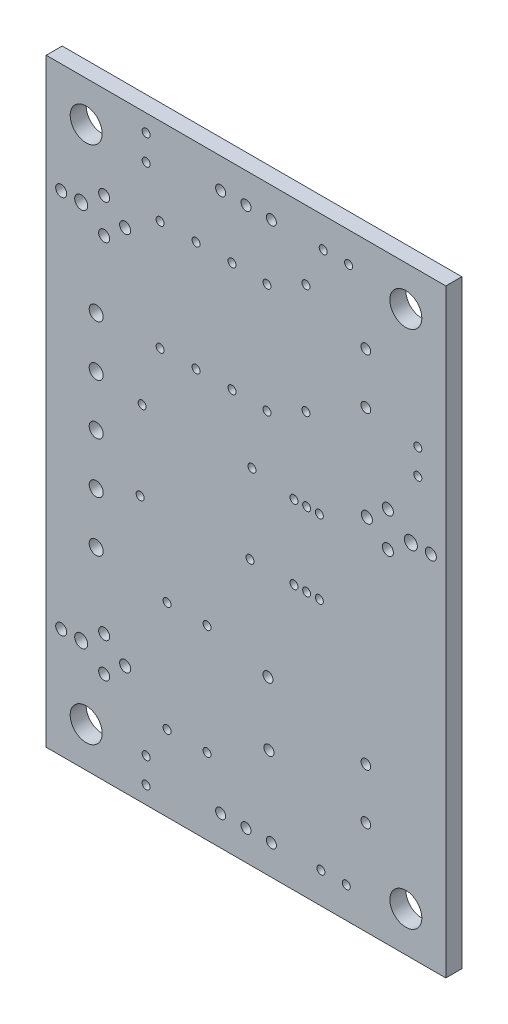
from build123d import *

# Parameters (mm, degrees)
MODEL_W            = 40.006466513
MODEL_H            = 60.009699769
MODEL_R            = 0.398845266
MODEL_R_2          = 0.701154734
MODEL_R_3          = 0.482678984
MODEL_R_4          = 0.551270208
MODEL_R_5          = 0.65034642
MODEL_R_6          = 1.600461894
MODEL_R_7          = 0.500461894
BOSS_EXTRU_1_DEPTH = 1.6


with BuildPart() as part:
    # Model → Boss.-Extru.1 (new body)
    with BuildSketch(Plane.XY):
        with Locations((20.003233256, 30.004849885)):
            Rectangle(MODEL_W, MODEL_H)
        with Locations((37.206928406, 42.1073903)):
            Circle(MODEL_R, mode=Mode.SUBTRACT)
        with Locations((37.206928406, 44.647806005)):
            Circle(MODEL_R, mode=Mode.SUBTRACT)
        with Locations((5.002078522, 35.085681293)):
            Circle(MODEL_R_2, mode=Mode.SUBTRACT)
        with Locations((5.002078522, 40.166512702)):
            Circle(MODEL_R_2, mode=Mode.SUBTRACT)
        with Locations((5.002078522, 30.004849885)):
            Circle(MODEL_R_2, mode=Mode.SUBTRACT)
        with Locations((5.002078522, 24.924018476)):
            Circle(MODEL_R_2, mode=Mode.SUBTRACT)
        with Locations((5.002078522, 19.843187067)):
            Circle(MODEL_R_2, mode=Mode.SUBTRACT)
        with Locations((32.004157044, 45.468360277)):
            Circle(MODEL_R_3, mode=Mode.SUBTRACT)
        with Locations((32.004157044, 50.549191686)):
            Circle(MODEL_R_3, mode=Mode.SUBTRACT)
        with Locations((32.004157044, 9.460508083)):
            Circle(MODEL_R_3, mode=Mode.SUBTRACT)
        with Locations((32.004157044, 14.541339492)):
            Circle(MODEL_R_3, mode=Mode.SUBTRACT)
        with Locations((1.498845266, 11.002540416)):
            Circle(MODEL_R_4, mode=Mode.SUBTRACT)
        with Locations((7.900692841, 11.002540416)):
            Circle(MODEL_R_4, mode=Mode.SUBTRACT)
        with Locations((5.799769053, 9.252193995)):
            Circle(MODEL_R_4, mode=Mode.SUBTRACT)
        with Locations((5.799769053, 12.752886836)):
            Circle(MODEL_R_4, mode=Mode.SUBTRACT)
        with Locations((3.500692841, 11.002540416)):
            Circle(MODEL_R_5, mode=Mode.SUBTRACT)
        with Locations((1.498845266, 49.009699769)):
            Circle(MODEL_R_4, mode=Mode.SUBTRACT)
        with Locations((7.900692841, 49.009699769)):
            Circle(MODEL_R_4, mode=Mode.SUBTRACT)
        with Locations((5.799769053, 47.259353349)):
            Circle(MODEL_R_4, mode=Mode.SUBTRACT)
        with Locations((5.799769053, 50.760046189)):
            Circle(MODEL_R_4, mode=Mode.SUBTRACT)
        with Locations((3.500692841, 49.009699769)):
            Circle(MODEL_R_5, mode=Mode.SUBTRACT)
        with Locations((38.507621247, 36.005311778)):
            Circle(MODEL_R_4, mode=Mode.SUBTRACT)
        with Locations((32.105773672, 36.005311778)):
            Circle(MODEL_R_4, mode=Mode.SUBTRACT)
        with Locations((34.20669746, 37.755658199)):
            Circle(MODEL_R_4, mode=Mode.SUBTRACT)
        with Locations((34.20669746, 34.254965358)):
            Circle(MODEL_R_4, mode=Mode.SUBTRACT)
        with Locations((36.505773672, 36.005311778)):
            Circle(MODEL_R_5, mode=Mode.SUBTRACT)
        with Locations((4.001154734, 4.001154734)):
            Circle(MODEL_R_6, mode=Mode.SUBTRACT)
        with Locations((4.001154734, 56.008545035)):
            Circle(MODEL_R_6, mode=Mode.SUBTRACT)
        with Locations((36.005311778, 4.001154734)):
            Circle(MODEL_R_6, mode=Mode.SUBTRACT)
        with Locations((36.005311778, 56.008545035)):
            Circle(MODEL_R_6, mode=Mode.SUBTRACT)
        with Locations((17.462817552, 3.000230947)):
            Circle(MODEL_R_7, mode=Mode.SUBTRACT)
        with Locations((20.003233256, 3.000230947)):
            Circle(MODEL_R_7, mode=Mode.SUBTRACT)
        with Locations((22.543648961, 3.000230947)):
            Circle(MODEL_R_7, mode=Mode.SUBTRACT)
        with Locations((22.543648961, 57.009468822)):
            Circle(MODEL_R_7, mode=Mode.SUBTRACT)
        with Locations((20.003233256, 57.009468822)):
            Circle(MODEL_R_7, mode=Mode.SUBTRACT)
        with Locations((17.462817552, 57.009468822)):
            Circle(MODEL_R_7, mode=Mode.SUBTRACT)
        with Locations((10.001616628, 1.730023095)):
            Circle(MODEL_R, mode=Mode.SUBTRACT)
        with Locations((10.001616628, 4.270438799)):
            Circle(MODEL_R, mode=Mode.SUBTRACT)
        with Locations((27.505080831, 3.099307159)):
            Circle(MODEL_R, mode=Mode.SUBTRACT)
        with Locations((30.045496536, 3.099307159)):
            Circle(MODEL_R, mode=Mode.SUBTRACT)
        with Locations((10.001616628, 55.73926097)):
            Circle(MODEL_R, mode=Mode.SUBTRACT)
        with Locations((10.001616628, 58.279676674)):
            Circle(MODEL_R, mode=Mode.SUBTRACT)
        with Locations((27.733718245, 57.009468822)):
            Circle(MODEL_R, mode=Mode.SUBTRACT)
        with Locations((30.274133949, 57.009468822)):
            Circle(MODEL_R, mode=Mode.SUBTRACT)
        with Locations((26.00369515, 42.1073903)):
            Circle(MODEL_R, mode=Mode.SUBTRACT)
        with Locations((26.00369515, 53.109930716)):
            Circle(MODEL_R, mode=Mode.SUBTRACT)
        with Locations((12.102540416, 7.600923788)):
            Circle(MODEL_R, mode=Mode.SUBTRACT)
        with Locations((12.102540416, 18.603464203)):
            Circle(MODEL_R, mode=Mode.SUBTRACT)
        with Locations((22.104157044, 51.207159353)):
            Circle(MODEL_R, mode=Mode.SUBTRACT)
        with Locations((22.104157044, 40.207159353)):
            Circle(MODEL_R, mode=Mode.SUBTRACT)
        with Locations((9.602771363, 34.506466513)):
            Circle(MODEL_R, mode=Mode.SUBTRACT)
        with Locations((20.602771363, 34.506466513)):
            Circle(MODEL_R, mode=Mode.SUBTRACT)
        with Locations((16.10369515, 7.600923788)):
            Circle(MODEL_R, mode=Mode.SUBTRACT)
        with Locations((16.10369515, 18.603464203)):
            Circle(MODEL_R, mode=Mode.SUBTRACT)
        with Locations((11.401385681, 40.306235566)):
            Circle(MODEL_R, mode=Mode.SUBTRACT)
        with Locations((11.401385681, 51.308775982)):
            Circle(MODEL_R, mode=Mode.SUBTRACT)
        with Locations((9.402078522, 26.504157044)):
            Circle(MODEL_R, mode=Mode.SUBTRACT)
        with Locations((20.402078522, 26.504157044)):
            Circle(MODEL_R, mode=Mode.SUBTRACT)
        with Locations((18.603464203, 51.308775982)):
            Circle(MODEL_R, mode=Mode.SUBTRACT)
        with Locations((18.603464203, 40.306235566)):
            Circle(MODEL_R, mode=Mode.SUBTRACT)
        with Locations((15.00369515, 51.308775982)):
            Circle(MODEL_R, mode=Mode.SUBTRACT)
        with Locations((15.00369515, 40.306235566)):
            Circle(MODEL_R, mode=Mode.SUBTRACT)
        with Locations((24.804618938, 26.504157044)):
            Circle(MODEL_R, mode=Mode.SUBTRACT)
        with Locations((26.07482679, 26.504157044)):
            Circle(MODEL_R, mode=Mode.SUBTRACT)
        with Locations((27.345034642, 26.504157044)):
            Circle(MODEL_R, mode=Mode.SUBTRACT)
        with Locations((24.804618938, 33.904387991)):
            Circle(MODEL_R, mode=Mode.SUBTRACT)
        with Locations((26.07482679, 33.904387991)):
            Circle(MODEL_R, mode=Mode.SUBTRACT)
        with Locations((27.345034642, 33.904387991)):
            Circle(MODEL_R, mode=Mode.SUBTRACT)
        with Locations((22.304849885, 10.900923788)):
            Circle(MODEL_R_7, mode=Mode.SUBTRACT)
        with Locations((22.203233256, 17.20369515)):
            Circle(MODEL_R_7, mode=Mode.SUBTRACT)
    extrude(amount=BOSS_EXTRU_1_DEPTH)


solid = part.part
